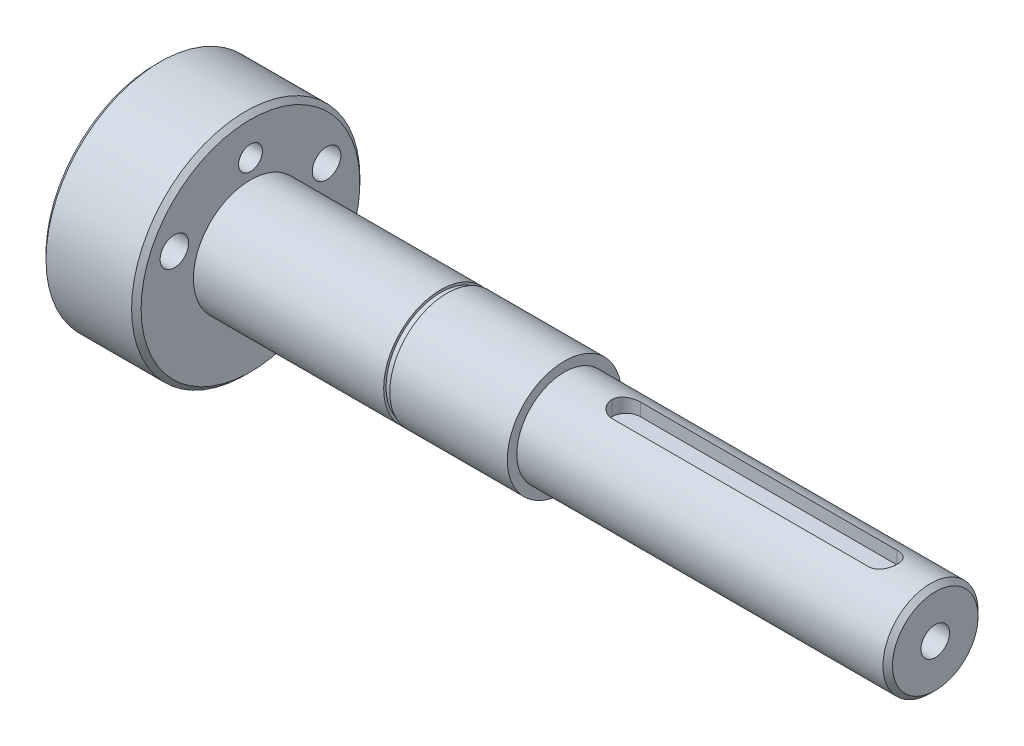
ISO-10303-21;
HEADER;
FILE_DESCRIPTION(('STEP AP214'),'2;1');
FILE_NAME('part.step','',(''),(''),'','','');
FILE_SCHEMA(('AUTOMOTIVE_DESIGN { 1 0 10303 214 1 1 1 1 }'));
ENDSEC;
DATA;
#1=APPLICATION_CONTEXT('core data for automotive mechanical design processes');
#2=APPLICATION_PROTOCOL_DEFINITION('international standard','automotive_design',2000,#1);
#3=PRODUCT_CONTEXT('',#1,'mechanical');
#4=PRODUCT('Part','Part','',(#3));
#5=PRODUCT_RELATED_PRODUCT_CATEGORY('part','',(#4));
#6=PRODUCT_DEFINITION_FORMATION('','',#4);
#7=PRODUCT_DEFINITION_CONTEXT('part definition',#1,'design');
#8=PRODUCT_DEFINITION('design','',#6,#7);
#9=PRODUCT_DEFINITION_SHAPE('','',#8);
#10=(LENGTH_UNIT() NAMED_UNIT(*) SI_UNIT(.MILLI.,.METRE.));
#11=(NAMED_UNIT(*) PLANE_ANGLE_UNIT() SI_UNIT($,.RADIAN.));
#12=(NAMED_UNIT(*) SI_UNIT($,.STERADIAN.) SOLID_ANGLE_UNIT());
#13=UNCERTAINTY_MEASURE_WITH_UNIT(LENGTH_MEASURE(1.E-05),#10,'distance_accuracy_value','');
#14=(GEOMETRIC_REPRESENTATION_CONTEXT(3) GLOBAL_UNCERTAINTY_ASSIGNED_CONTEXT((#13)) GLOBAL_UNIT_ASSIGNED_CONTEXT((#10,
#11,#12)) REPRESENTATION_CONTEXT('',''));
#15=CARTESIAN_POINT('',(0.,0.,0.));
#16=DIRECTION('',(0.,0.,1.));
#17=DIRECTION('',(1.,0.,0.));
#18=AXIS2_PLACEMENT_3D('',#15,#16,#17);
#19=CARTESIAN_POINT('',(0.,0.,0.));
#20=DIRECTION('',(-1.,0.,0.));
#21=DIRECTION('',(0.,0.,1.));
#22=AXIS2_PLACEMENT_3D('',#19,#20,#21);
#23=CYLINDRICAL_SURFACE('',#22,9.99999999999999);
#24=CARTESIAN_POINT('',(163.,0.,0.));
#25=DIRECTION('',(-1.,0.,0.));
#26=DIRECTION('',(0.,0.,1.));
#27=AXIS2_PLACEMENT_3D('',#24,#25,#26);
#28=CIRCLE('',#27,9.99999999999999);
#29=CARTESIAN_POINT('',(163.,0.,9.99999999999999));
#30=VERTEX_POINT('',#29);
#31=EDGE_CURVE('E41',#30,#30,#28,.T.);
#32=ORIENTED_EDGE('',*,*,#31,.T.);
#33=EDGE_LOOP('',(#32));
#34=FACE_BOUND('',#33,.T.);
#35=CARTESIAN_POINT('',(86.,0.,0.));
#36=DIRECTION('',(-1.,0.,0.));
#37=DIRECTION('',(0.,0.,1.));
#38=AXIS2_PLACEMENT_3D('',#35,#36,#37);
#39=CIRCLE('',#38,9.99999999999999);
#40=CARTESIAN_POINT('',(86.,0.,9.99999999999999));
#41=VERTEX_POINT('',#40);
#42=EDGE_CURVE('E114',#41,#41,#39,.T.);
#43=ORIENTED_EDGE('',*,*,#42,.F.);
#44=EDGE_LOOP('',(#43));
#45=FACE_BOUND('',#44,.T.);
#46=DIRECTION('',(-1.,0.,0.));
#47=VECTOR('',#46,1.);
#48=CARTESIAN_POINT('',(0.,9.53939201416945,3.));
#49=LINE('',#48,#47);
#50=CARTESIAN_POINT('',(99.,9.53939201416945,3.));
#51=VERTEX_POINT('',#50);
#52=CARTESIAN_POINT('',(153.,9.53939201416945,3.));
#53=VERTEX_POINT('',#52);
#54=EDGE_CURVE('E123',#51,#53,#49,.F.);
#55=ORIENTED_EDGE('',*,*,#54,.F.);
#56=CARTESIAN_POINT('',(99.,9.53939201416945,3.));
#57=CARTESIAN_POINT('',(98.9176616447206,9.53938054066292,3.00001028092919));
#58=CARTESIAN_POINT('',(98.8353298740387,9.54045779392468,2.9966103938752));
#59=CARTESIAN_POINT('',(98.671294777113,9.54470448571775,2.98307026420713));
#60=CARTESIAN_POINT('',(98.5895913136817,9.5478734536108,2.97293153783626));
#61=CARTESIAN_POINT('',(98.4276012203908,9.55620753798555,2.94602863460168));
#62=CARTESIAN_POINT('',(98.3473114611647,9.56136744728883,2.92928173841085));
#63=CARTESIAN_POINT('',(98.1885187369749,9.57351674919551,2.88932692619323));
#64=CARTESIAN_POINT('',(98.1100158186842,9.58050618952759,2.86611884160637));
#65=CARTESIAN_POINT('',(97.8780531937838,9.60391611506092,2.78708673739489));
#66=CARTESIAN_POINT('',(97.7279365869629,9.62278944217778,2.72182078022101));
#67=CARTESIAN_POINT('',(97.4407785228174,9.66493136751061,2.5681533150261));
#68=CARTESIAN_POINT('',(97.3037436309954,9.68820215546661,2.47974027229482));
#69=CARTESIAN_POINT('',(97.0422787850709,9.73733616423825,2.27930040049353));
#70=CARTESIAN_POINT('',(96.9183185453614,9.76325431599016,2.16667315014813));
#71=CARTESIAN_POINT('',(96.6907289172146,9.81429568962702,1.92227974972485));
#72=CARTESIAN_POINT('',(96.5871034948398,9.83941875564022,1.79050987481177));
#73=CARTESIAN_POINT('',(96.4010451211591,9.88667183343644,1.50818045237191));
#74=CARTESIAN_POINT('',(96.3191023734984,9.90872799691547,1.35728471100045));
#75=CARTESIAN_POINT('',(96.1819863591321,9.94670010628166,1.04312670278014));
#76=CARTESIAN_POINT('',(96.1267899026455,9.96262136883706,0.879875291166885));
#77=CARTESIAN_POINT('',(96.0574621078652,9.98287420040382,0.596528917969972));
#78=CARTESIAN_POINT('',(96.0359572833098,9.98925529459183,0.478332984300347));
#79=CARTESIAN_POINT('',(96.0072119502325,9.9978363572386,0.240114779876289));
#80=CARTESIAN_POINT('',(95.9999664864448,10.0000377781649,0.120093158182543));
#81=CARTESIAN_POINT('',(96.,9.99999999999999,0.));
#82=B_SPLINE_CURVE_WITH_KNOTS('',3,(#56,#57,#58,#59,#60,#61,#62,#63,#64,#65,#66,#67,#68,#69,#70,
#71,#72,#73,#74,#75,#76,#77,#78,#79,#80,#81),.UNSPECIFIED.,.F.,.F.,(4,2,2,2,2,2,2,2,2,2,2,2,4),
(0.,0.246926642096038,0.493797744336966,0.740027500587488,0.986263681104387,1.47812528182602,
1.97023245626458,2.47634460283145,2.98255536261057,3.49938590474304,4.0157675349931,
4.37580149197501,4.73571031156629),.UNSPECIFIED.);
#83=CARTESIAN_POINT('',(96.,9.99999999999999,0.));
#84=VERTEX_POINT('',#83);
#85=EDGE_CURVE('E56',#51,#84,#82,.T.);
#86=ORIENTED_EDGE('',*,*,#85,.T.);
#87=CARTESIAN_POINT('',(96.,9.99999999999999,0.));
#88=CARTESIAN_POINT('',(95.9999899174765,10.0000096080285,-0.082422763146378));
#89=CARTESIAN_POINT('',(96.0033965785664,9.99898119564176,-0.164839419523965));
#90=CARTESIAN_POINT('',(96.0169651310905,9.99491972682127,-0.3290491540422));
#91=CARTESIAN_POINT('',(96.0271256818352,9.99188706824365,-0.41084235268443));
#92=CARTESIAN_POINT('',(96.05409089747,9.98389820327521,-0.573029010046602));
#93=CARTESIAN_POINT('',(96.0708793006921,9.97894670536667,-0.653425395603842));
#94=CARTESIAN_POINT('',(96.1109371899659,9.96726244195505,-0.81243293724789));
#95=CARTESIAN_POINT('',(96.1342068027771,9.9605296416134,-0.891044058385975));
#96=CARTESIAN_POINT('',(96.2134619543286,9.93791665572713,-1.12334751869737));
#97=CARTESIAN_POINT('',(96.27892464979,9.91961224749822,-1.27369353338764));
#98=CARTESIAN_POINT('',(96.4330525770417,9.87844788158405,-1.56123419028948));
#99=CARTESIAN_POINT('',(96.5217275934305,9.8555860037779,-1.69842325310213));
#100=CARTESIAN_POINT('',(96.7224413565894,9.80701615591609,-1.95973032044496));
#101=CARTESIAN_POINT('',(96.8350212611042,9.78125020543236,-2.08342255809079));
#102=CARTESIAN_POINT('',(97.0792077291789,9.73011891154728,-2.31049087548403));
#103=CARTESIAN_POINT('',(97.2108192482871,9.70475367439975,-2.41386164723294));
#104=CARTESIAN_POINT('',(97.4929875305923,9.65667399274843,-2.59963260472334));
#105=CARTESIAN_POINT('',(97.6439077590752,9.63403315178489,-2.68150106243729));
#106=CARTESIAN_POINT('',(97.9581096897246,9.59485969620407,-2.81846982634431));
#107=CARTESIAN_POINT('',(98.1213795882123,9.57832133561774,-2.8735953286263));
#108=CARTESIAN_POINT('',(98.4045358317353,9.5572569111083,-2.94274344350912));
#109=CARTESIAN_POINT('',(98.5225073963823,9.55060700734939,-2.96416883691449));
#110=CARTESIAN_POINT('',(98.7602947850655,9.5416524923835,-2.99281255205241));
#111=CARTESIAN_POINT('',(98.8801101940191,9.5393469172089,-3.00003402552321));
#112=CARTESIAN_POINT('',(99.,9.53939201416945,-3.));
#113=B_SPLINE_CURVE_WITH_KNOTS('',3,(#87,#88,#89,#90,#91,#92,#93,#94,#95,#96,#97,#98,#99,#100,
#101,#102,#103,#104,#105,#106,#107,#108,#109,#110,#111,#112),.UNSPECIFIED.,.F.,.F.,(4,2,2,2,2,2,
2,2,2,2,2,2,4),(0.,0.24718104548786,0.494313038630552,0.740842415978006,0.987376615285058,
1.47989284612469,1.9726170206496,2.47798531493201,2.98348543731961,3.50050825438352,
4.01704300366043,4.37641607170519,4.73570938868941),.UNSPECIFIED.);
#114=CARTESIAN_POINT('',(99.,9.53939201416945,-3.));
#115=VERTEX_POINT('',#114);
#116=EDGE_CURVE('E146',#84,#115,#113,.T.);
#117=ORIENTED_EDGE('',*,*,#116,.T.);
#118=DIRECTION('',(-1.,0.,0.));
#119=VECTOR('',#118,1.);
#120=CARTESIAN_POINT('',(0.,9.53939201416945,-3.));
#121=LINE('',#120,#119);
#122=CARTESIAN_POINT('',(153.,9.53939201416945,-3.));
#123=VERTEX_POINT('',#122);
#124=EDGE_CURVE('E126',#115,#123,#121,.F.);
#125=ORIENTED_EDGE('',*,*,#124,.T.);
#126=CARTESIAN_POINT('',(153.,9.53939201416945,-3.));
#127=CARTESIAN_POINT('',(153.082338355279,9.53938054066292,-3.00001028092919));
#128=CARTESIAN_POINT('',(153.164670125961,9.54045779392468,-2.9966103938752));
#129=CARTESIAN_POINT('',(153.328705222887,9.54470448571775,-2.98307026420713));
#130=CARTESIAN_POINT('',(153.410408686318,9.5478734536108,-2.97293153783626));
#131=CARTESIAN_POINT('',(153.572398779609,9.55620753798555,-2.94602863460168));
#132=CARTESIAN_POINT('',(153.652688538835,9.56136744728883,-2.92928173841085));
#133=CARTESIAN_POINT('',(153.811481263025,9.57351674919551,-2.88932692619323));
#134=CARTESIAN_POINT('',(153.889984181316,9.58050618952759,-2.86611884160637));
#135=CARTESIAN_POINT('',(154.121946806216,9.60391611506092,-2.7870867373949));
#136=CARTESIAN_POINT('',(154.272063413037,9.62278944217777,-2.72182078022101));
#137=CARTESIAN_POINT('',(154.559221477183,9.66493136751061,-2.5681533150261));
#138=CARTESIAN_POINT('',(154.696256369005,9.68820215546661,-2.47974027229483));
#139=CARTESIAN_POINT('',(154.957721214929,9.73733616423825,-2.27930040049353));
#140=CARTESIAN_POINT('',(155.081681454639,9.76325431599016,-2.16667315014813));
#141=CARTESIAN_POINT('',(155.309271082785,9.81429568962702,-1.92227974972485));
#142=CARTESIAN_POINT('',(155.41289650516,9.83941875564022,-1.79050987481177));
#143=CARTESIAN_POINT('',(155.598954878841,9.88667183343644,-1.50818045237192));
#144=CARTESIAN_POINT('',(155.680897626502,9.90872799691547,-1.35728471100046));
#145=CARTESIAN_POINT('',(155.818013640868,9.94670010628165,-1.04312670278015));
#146=CARTESIAN_POINT('',(155.873210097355,9.96262136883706,-0.879875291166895));
#147=CARTESIAN_POINT('',(155.942537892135,9.98287420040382,-0.596528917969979));
#148=CARTESIAN_POINT('',(155.96404271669,9.98925529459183,-0.478332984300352));
#149=CARTESIAN_POINT('',(155.992788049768,9.9978363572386,-0.240114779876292));
#150=CARTESIAN_POINT('',(156.000033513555,10.0000377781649,-0.120093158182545));
#151=CARTESIAN_POINT('',(156.,9.99999999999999,0.));
#152=B_SPLINE_CURVE_WITH_KNOTS('',3,(#126,#127,#128,#129,#130,#131,#132,#133,#134,#135,#136,
#137,#138,#139,#140,#141,#142,#143,#144,#145,#146,#147,#148,#149,#150,#151),.UNSPECIFIED.,.F.,
.F.,(4,2,2,2,2,2,2,2,2,2,2,2,4),(0.,0.246926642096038,0.493797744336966,0.740027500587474,
0.986263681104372,1.47812528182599,1.97023245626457,2.47634460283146,2.98255536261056,
3.49938590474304,4.0157675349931,4.37580149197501,4.73571031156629),.UNSPECIFIED.);
#153=CARTESIAN_POINT('',(156.,9.99999999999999,0.));
#154=VERTEX_POINT('',#153);
#155=EDGE_CURVE('E49',#123,#154,#152,.T.);
#156=ORIENTED_EDGE('',*,*,#155,.T.);
#157=CARTESIAN_POINT('',(156.,9.99999999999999,0.));
#158=CARTESIAN_POINT('',(156.000010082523,10.0000096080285,0.0824227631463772));
#159=CARTESIAN_POINT('',(155.996603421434,9.99898119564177,0.164839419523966));
#160=CARTESIAN_POINT('',(155.983034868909,9.99491972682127,0.329049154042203));
#161=CARTESIAN_POINT('',(155.972874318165,9.99188706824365,0.410842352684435));
#162=CARTESIAN_POINT('',(155.94590910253,9.98389820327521,0.573029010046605));
#163=CARTESIAN_POINT('',(155.929120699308,9.97894670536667,0.653425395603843));
#164=CARTESIAN_POINT('',(155.889062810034,9.96726244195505,0.812432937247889));
#165=CARTESIAN_POINT('',(155.865793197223,9.9605296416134,0.891044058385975));
#166=CARTESIAN_POINT('',(155.786538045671,9.93791665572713,1.12334751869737));
#167=CARTESIAN_POINT('',(155.72107535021,9.91961224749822,1.27369353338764));
#168=CARTESIAN_POINT('',(155.566947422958,9.87844788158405,1.56123419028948));
#169=CARTESIAN_POINT('',(155.47827240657,9.8555860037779,1.69842325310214));
#170=CARTESIAN_POINT('',(155.277558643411,9.80701615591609,1.95973032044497));
#171=CARTESIAN_POINT('',(155.164978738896,9.78125020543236,2.0834225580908));
#172=CARTESIAN_POINT('',(154.920792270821,9.73011891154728,2.31049087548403));
#173=CARTESIAN_POINT('',(154.789180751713,9.70475367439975,2.41386164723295));
#174=CARTESIAN_POINT('',(154.507012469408,9.65667399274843,2.59963260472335));
#175=CARTESIAN_POINT('',(154.356092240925,9.63403315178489,2.68150106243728));
#176=CARTESIAN_POINT('',(154.041890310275,9.59485969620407,2.81846982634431));
#177=CARTESIAN_POINT('',(153.878620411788,9.57832133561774,2.8735953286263));
#178=CARTESIAN_POINT('',(153.595464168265,9.5572569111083,2.94274344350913));
#179=CARTESIAN_POINT('',(153.477492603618,9.55060700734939,2.96416883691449));
#180=CARTESIAN_POINT('',(153.239705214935,9.5416524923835,2.9928125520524));
#181=CARTESIAN_POINT('',(153.119889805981,9.5393469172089,3.00003402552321));
#182=CARTESIAN_POINT('',(153.,9.53939201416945,3.));
#183=B_SPLINE_CURVE_WITH_KNOTS('',3,(#157,#158,#159,#160,#161,#162,#163,#164,#165,#166,#167,
#168,#169,#170,#171,#172,#173,#174,#175,#176,#177,#178,#179,#180,#181,#182),.UNSPECIFIED.,.F.,
.F.,(4,2,2,2,2,2,2,2,2,2,2,2,4),(0.,0.247181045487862,0.494313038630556,0.740842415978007,
0.98737661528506,1.47989284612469,1.9726170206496,2.47798531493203,2.98348543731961,
3.5005082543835,4.01704300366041,4.37641607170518,4.73570938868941),.UNSPECIFIED.);
#184=EDGE_CURVE('E183',#154,#53,#183,.T.);
#185=ORIENTED_EDGE('',*,*,#184,.T.);
#186=EDGE_LOOP('',(#55,#86,#117,#125,#156,#185));
#187=FACE_BOUND('',#186,.T.);
#188=ADVANCED_FACE('F32',(#34,#45,#187),#23,.T.);
#189=CARTESIAN_POINT('',(0.,0.,0.));
#190=DIRECTION('',(-1.,0.,0.));
#191=DIRECTION('',(0.,0.,1.));
#192=AXIS2_PLACEMENT_3D('',#189,#190,#191);
#193=CYLINDRICAL_SURFACE('',#192,12.);
#194=CARTESIAN_POINT('',(86.,0.,0.));
#195=DIRECTION('',(-1.,0.,0.));
#196=DIRECTION('',(0.,0.,1.));
#197=AXIS2_PLACEMENT_3D('',#194,#195,#196);
#198=CIRCLE('',#197,12.);
#199=CARTESIAN_POINT('',(86.,0.,12.));
#200=VERTEX_POINT('',#199);
#201=EDGE_CURVE('E117',#200,#200,#198,.T.);
#202=ORIENTED_EDGE('',*,*,#201,.T.);
#203=EDGE_LOOP('',(#202));
#204=FACE_BOUND('',#203,.T.);
#205=CARTESIAN_POINT('',(61.3,0.,0.));
#206=DIRECTION('',(-1.,0.,0.));
#207=DIRECTION('',(0.,0.,1.));
#208=AXIS2_PLACEMENT_3D('',#205,#206,#207);
#209=CIRCLE('',#208,12.);
#210=CARTESIAN_POINT('',(61.3,0.,12.));
#211=VERTEX_POINT('',#210);
#212=EDGE_CURVE('E105',#211,#211,#209,.T.);
#213=ORIENTED_EDGE('',*,*,#212,.F.);
#214=EDGE_LOOP('',(#213));
#215=FACE_BOUND('',#214,.T.);
#216=ADVANCED_FACE('F241',(#204,#215),#193,.T.);
#217=CARTESIAN_POINT('',(86.,12.,0.));
#218=DIRECTION('',(-1.,0.,0.));
#219=DIRECTION('',(0.,0.,1.));
#220=AXIS2_PLACEMENT_3D('',#217,#218,#219);
#221=PLANE('',#220);
#222=ORIENTED_EDGE('',*,*,#201,.F.);
#223=EDGE_LOOP('',(#222));
#224=FACE_BOUND('',#223,.T.);
#225=ORIENTED_EDGE('',*,*,#42,.T.);
#226=EDGE_LOOP('',(#225));
#227=FACE_BOUND('',#226,.T.);
#228=ADVANCED_FACE('F243',(#224,#227),#221,.F.);
#229=CARTESIAN_POINT('',(164.,9.99999999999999,0.));
#230=DIRECTION('',(-1.,0.,0.));
#231=DIRECTION('',(0.,0.,1.));
#232=AXIS2_PLACEMENT_3D('',#229,#230,#231);
#233=PLANE('',#232);
#234=CARTESIAN_POINT('',(164.,0.,0.));
#235=DIRECTION('',(-1.,0.,0.));
#236=DIRECTION('',(0.,0.,1.));
#237=AXIS2_PLACEMENT_3D('',#234,#235,#236);
#238=CIRCLE('',#237,8.99999999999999);
#239=CARTESIAN_POINT('',(164.,0.,8.99999999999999));
#240=VERTEX_POINT('',#239);
#241=EDGE_CURVE('E11',#240,#240,#238,.F.);
#242=ORIENTED_EDGE('',*,*,#241,.T.);
#243=EDGE_LOOP('',(#242));
#244=FACE_BOUND('',#243,.T.);
#245=CARTESIAN_POINT('',(164.,0.,0.));
#246=DIRECTION('',(1.,0.,0.));
#247=DIRECTION('',(0.,0.,-1.));
#248=AXIS2_PLACEMENT_3D('',#245,#246,#247);
#249=CIRCLE('',#248,3.);
#250=CARTESIAN_POINT('',(164.,0.,-3.));
#251=VERTEX_POINT('',#250);
#252=EDGE_CURVE('E111',#251,#251,#249,.T.);
#253=ORIENTED_EDGE('',*,*,#252,.F.);
#254=EDGE_LOOP('',(#253));
#255=FACE_BOUND('',#254,.T.);
#256=ADVANCED_FACE('F251',(#244,#255),#233,.F.);
#257=CARTESIAN_POINT('',(164.,0.,0.));
#258=DIRECTION('',(1.,0.,0.));
#259=DIRECTION('',(0.,0.,-1.));
#260=AXIS2_PLACEMENT_3D('',#257,#258,#259);
#261=CYLINDRICAL_SURFACE('',#260,3.);
#262=CARTESIAN_POINT('',(152.,0.,0.));
#263=DIRECTION('',(1.,0.,0.));
#264=DIRECTION('',(0.,0.,-1.));
#265=AXIS2_PLACEMENT_3D('',#262,#263,#264);
#266=CIRCLE('',#265,3.);
#267=CARTESIAN_POINT('',(152.,0.,-3.));
#268=VERTEX_POINT('',#267);
#269=EDGE_CURVE('E102',#268,#268,#266,.T.);
#270=ORIENTED_EDGE('',*,*,#269,.F.);
#271=EDGE_LOOP('',(#270));
#272=FACE_BOUND('',#271,.T.);
#273=ORIENTED_EDGE('',*,*,#252,.T.);
#274=EDGE_LOOP('',(#273));
#275=FACE_BOUND('',#274,.T.);
#276=ADVANCED_FACE('F285',(#272,#275),#261,.F.);
#277=CARTESIAN_POINT('',(152.,2.5,0.));
#278=DIRECTION('',(-1.,0.,0.));
#279=DIRECTION('',(0.,0.,1.));
#280=AXIS2_PLACEMENT_3D('',#277,#278,#279);
#281=PLANE('',#280);
#282=CARTESIAN_POINT('',(152.,0.,0.));
#283=DIRECTION('',(1.,0.,0.));
#284=DIRECTION('',(0.,0.,-1.));
#285=AXIS2_PLACEMENT_3D('',#282,#283,#284);
#286=CIRCLE('',#285,2.5);
#287=CARTESIAN_POINT('',(152.,0.,-2.5));
#288=VERTEX_POINT('',#287);
#289=EDGE_CURVE('E98',#288,#288,#286,.T.);
#290=ORIENTED_EDGE('',*,*,#289,.F.);
#291=EDGE_LOOP('',(#290));
#292=FACE_BOUND('',#291,.T.);
#293=ORIENTED_EDGE('',*,*,#269,.T.);
#294=EDGE_LOOP('',(#293));
#295=FACE_BOUND('',#294,.T.);
#296=ADVANCED_FACE('F282',(#292,#295),#281,.F.);
#297=CARTESIAN_POINT('',(164.,0.,0.));
#298=DIRECTION('',(1.,0.,0.));
#299=DIRECTION('',(0.,0.,-1.));
#300=AXIS2_PLACEMENT_3D('',#297,#298,#299);
#301=CYLINDRICAL_SURFACE('',#300,2.5);
#302=CARTESIAN_POINT('',(147.,0.,0.));
#303=DIRECTION('',(1.,0.,0.));
#304=DIRECTION('',(0.,0.,-1.));
#305=AXIS2_PLACEMENT_3D('',#302,#303,#304);
#306=CIRCLE('',#305,2.5);
#307=CARTESIAN_POINT('',(147.,0.,-2.5));
#308=VERTEX_POINT('',#307);
#309=EDGE_CURVE('E96',#308,#308,#306,.T.);
#310=ORIENTED_EDGE('',*,*,#309,.F.);
#311=EDGE_LOOP('',(#310));
#312=FACE_BOUND('',#311,.T.);
#313=ORIENTED_EDGE('',*,*,#289,.T.);
#314=EDGE_LOOP('',(#313));
#315=FACE_BOUND('',#314,.T.);
#316=ADVANCED_FACE('F92',(#312,#315),#301,.F.);
#317=CARTESIAN_POINT('',(147.,0.,0.));
#318=DIRECTION('',(1.,0.,0.));
#319=DIRECTION('',(0.,0.,-1.));
#320=AXIS2_PLACEMENT_3D('',#317,#318,#319);
#321=CONICAL_SURFACE('',#320,2.5,1.02974425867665);
#322=CARTESIAN_POINT('',(145.497848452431,0.,0.));
#323=VERTEX_POINT('',#322);
#324=VERTEX_LOOP('',#323);
#325=FACE_BOUND('',#324,.T.);
#326=ORIENTED_EDGE('',*,*,#309,.T.);
#327=EDGE_LOOP('',(#326));
#328=FACE_BOUND('',#327,.T.);
#329=ADVANCED_FACE('F88',(#325,#328),#321,.F.);
#330=CARTESIAN_POINT('',(60.,11.5,0.));
#331=DIRECTION('',(1.,0.,0.));
#332=DIRECTION('',(0.,0.,-1.));
#333=AXIS2_PLACEMENT_3D('',#330,#331,#332);
#334=PLANE('',#333);
#335=CARTESIAN_POINT('',(60.,0.,0.));
#336=DIRECTION('',(-1.,0.,0.));
#337=DIRECTION('',(0.,0.,1.));
#338=AXIS2_PLACEMENT_3D('',#335,#336,#337);
#339=CIRCLE('',#338,11.5);
#340=CARTESIAN_POINT('',(60.,0.,11.5));
#341=VERTEX_POINT('',#340);
#342=EDGE_CURVE('E230',#341,#341,#339,.T.);
#343=ORIENTED_EDGE('',*,*,#342,.T.);
#344=EDGE_LOOP('',(#343));
#345=FACE_BOUND('',#344,.T.);
#346=CARTESIAN_POINT('',(60.,0.,0.));
#347=DIRECTION('',(-1.,0.,0.));
#348=DIRECTION('',(0.,0.,1.));
#349=AXIS2_PLACEMENT_3D('',#346,#347,#348);
#350=CIRCLE('',#349,12.);
#351=CARTESIAN_POINT('',(60.,0.,12.));
#352=VERTEX_POINT('',#351);
#353=EDGE_CURVE('E99',#352,#352,#350,.T.);
#354=ORIENTED_EDGE('',*,*,#353,.F.);
#355=EDGE_LOOP('',(#354));
#356=FACE_BOUND('',#355,.T.);
#357=ADVANCED_FACE('F91',(#345,#356),#334,.T.);
#358=CARTESIAN_POINT('',(61.3,11.5,0.));
#359=DIRECTION('',(-1.,0.,0.));
#360=DIRECTION('',(0.,0.,1.));
#361=AXIS2_PLACEMENT_3D('',#358,#359,#360);
#362=PLANE('',#361);
#363=ORIENTED_EDGE('',*,*,#212,.T.);
#364=EDGE_LOOP('',(#363));
#365=FACE_BOUND('',#364,.T.);
#366=CARTESIAN_POINT('',(61.3,0.,0.));
#367=DIRECTION('',(-1.,0.,0.));
#368=DIRECTION('',(0.,0.,1.));
#369=AXIS2_PLACEMENT_3D('',#366,#367,#368);
#370=CIRCLE('',#369,11.5);
#371=CARTESIAN_POINT('',(61.3,0.,11.5));
#372=VERTEX_POINT('',#371);
#373=EDGE_CURVE('E233',#372,#372,#370,.T.);
#374=ORIENTED_EDGE('',*,*,#373,.F.);
#375=EDGE_LOOP('',(#374));
#376=FACE_BOUND('',#375,.T.);
#377=ADVANCED_FACE('F238',(#365,#376),#362,.T.);
#378=CARTESIAN_POINT('',(0.,0.,0.));
#379=DIRECTION('',(-1.,0.,0.));
#380=DIRECTION('',(0.,0.,1.));
#381=AXIS2_PLACEMENT_3D('',#378,#379,#380);
#382=CYLINDRICAL_SURFACE('',#381,11.5);
#383=ORIENTED_EDGE('',*,*,#373,.T.);
#384=EDGE_LOOP('',(#383));
#385=FACE_BOUND('',#384,.T.);
#386=ORIENTED_EDGE('',*,*,#342,.F.);
#387=EDGE_LOOP('',(#386));
#388=FACE_BOUND('',#387,.T.);
#389=ADVANCED_FACE('F276',(#385,#388),#382,.T.);
#390=CARTESIAN_POINT('',(0.,0.,0.));
#391=DIRECTION('',(1.,0.,0.));
#392=DIRECTION('',(0.,0.,-1.));
#393=AXIS2_PLACEMENT_3D('',#390,#391,#392);
#394=PLANE('',#393);
#395=CARTESIAN_POINT('',(0.,16.,0.));
#396=DIRECTION('',(-1.,0.,0.));
#397=DIRECTION('',(0.,0.,1.));
#398=AXIS2_PLACEMENT_3D('',#395,#396,#397);
#399=CIRCLE('',#398,2.5);
#400=CARTESIAN_POINT('',(0.,16.,2.5));
#401=VERTEX_POINT('',#400);
#402=EDGE_CURVE('E216',#401,#401,#399,.T.);
#403=ORIENTED_EDGE('',*,*,#402,.F.);
#404=EDGE_LOOP('',(#403));
#405=FACE_BOUND('',#404,.T.);
#406=CARTESIAN_POINT('',(0.,7.,16.));
#407=DIRECTION('',(-1.,0.,0.));
#408=DIRECTION('',(0.,0.,1.));
#409=AXIS2_PLACEMENT_3D('',#406,#407,#408);
#410=CIRCLE('',#409,3.);
#411=CARTESIAN_POINT('',(0.,7.,19.));
#412=VERTEX_POINT('',#411);
#413=EDGE_CURVE('E206',#412,#412,#410,.T.);
#414=ORIENTED_EDGE('',*,*,#413,.F.);
#415=EDGE_LOOP('',(#414));
#416=FACE_BOUND('',#415,.T.);
#417=CARTESIAN_POINT('',(0.,7.,-16.));
#418=DIRECTION('',(-1.,0.,0.));
#419=DIRECTION('',(0.,0.,1.));
#420=AXIS2_PLACEMENT_3D('',#417,#418,#419);
#421=CIRCLE('',#420,3.);
#422=CARTESIAN_POINT('',(0.,7.,-13.));
#423=VERTEX_POINT('',#422);
#424=EDGE_CURVE('E203',#423,#423,#421,.T.);
#425=ORIENTED_EDGE('',*,*,#424,.F.);
#426=EDGE_LOOP('',(#425));
#427=FACE_BOUND('',#426,.T.);
#428=CARTESIAN_POINT('',(0.,0.,0.));
#429=DIRECTION('',(1.,0.,0.));
#430=DIRECTION('',(0.,0.,-1.));
#431=AXIS2_PLACEMENT_3D('',#428,#429,#430);
#432=CIRCLE('',#431,23.);
#433=CARTESIAN_POINT('',(0.,0.,-23.));
#434=VERTEX_POINT('',#433);
#435=EDGE_CURVE('E195',#434,#434,#432,.F.);
#436=ORIENTED_EDGE('',*,*,#435,.T.);
#437=EDGE_LOOP('',(#436));
#438=FACE_BOUND('',#437,.T.);
#439=ADVANCED_FACE('F34',(#405,#416,#427,#438),#394,.F.);
#440=CARTESIAN_POINT('',(0.,0.,0.));
#441=DIRECTION('',(-1.,0.,0.));
#442=DIRECTION('',(0.,0.,1.));
#443=AXIS2_PLACEMENT_3D('',#440,#441,#442);
#444=CYLINDRICAL_SURFACE('',#443,24.);
#445=CARTESIAN_POINT('',(19.,0.,0.));
#446=DIRECTION('',(-1.,0.,0.));
#447=DIRECTION('',(0.,0.,1.));
#448=AXIS2_PLACEMENT_3D('',#445,#446,#447);
#449=CIRCLE('',#448,24.);
#450=CARTESIAN_POINT('',(19.,0.,24.));
#451=VERTEX_POINT('',#450);
#452=EDGE_CURVE('E189',#451,#451,#449,.T.);
#453=ORIENTED_EDGE('',*,*,#452,.T.);
#454=EDGE_LOOP('',(#453));
#455=FACE_BOUND('',#454,.T.);
#456=CARTESIAN_POINT('',(1.00000000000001,0.,0.));
#457=DIRECTION('',(1.,0.,0.));
#458=DIRECTION('',(0.,0.,-1.));
#459=AXIS2_PLACEMENT_3D('',#456,#457,#458);
#460=CIRCLE('',#459,24.);
#461=CARTESIAN_POINT('',(1.00000000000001,0.,-24.));
#462=VERTEX_POINT('',#461);
#463=EDGE_CURVE('E182',#462,#462,#460,.T.);
#464=ORIENTED_EDGE('',*,*,#463,.T.);
#465=EDGE_LOOP('',(#464));
#466=FACE_BOUND('',#465,.T.);
#467=ADVANCED_FACE('F264',(#455,#466),#444,.T.);
#468=CARTESIAN_POINT('',(20.,24.,0.));
#469=DIRECTION('',(-1.,0.,0.));
#470=DIRECTION('',(0.,0.,1.));
#471=AXIS2_PLACEMENT_3D('',#468,#469,#470);
#472=PLANE('',#471);
#473=CARTESIAN_POINT('',(20.,16.,0.));
#474=DIRECTION('',(-1.,0.,0.));
#475=DIRECTION('',(0.,0.,1.));
#476=AXIS2_PLACEMENT_3D('',#473,#474,#475);
#477=CIRCLE('',#476,2.5);
#478=CARTESIAN_POINT('',(20.,16.,2.5));
#479=VERTEX_POINT('',#478);
#480=EDGE_CURVE('E36',#479,#479,#477,.T.);
#481=ORIENTED_EDGE('',*,*,#480,.T.);
#482=EDGE_LOOP('',(#481));
#483=FACE_BOUND('',#482,.T.);
#484=CARTESIAN_POINT('',(20.,7.,16.));
#485=DIRECTION('',(-1.,0.,0.));
#486=DIRECTION('',(0.,0.,1.));
#487=AXIS2_PLACEMENT_3D('',#484,#485,#486);
#488=CIRCLE('',#487,3.);
#489=CARTESIAN_POINT('',(20.,7.,19.));
#490=VERTEX_POINT('',#489);
#491=EDGE_CURVE('E204',#490,#490,#488,.T.);
#492=ORIENTED_EDGE('',*,*,#491,.T.);
#493=EDGE_LOOP('',(#492));
#494=FACE_BOUND('',#493,.T.);
#495=CARTESIAN_POINT('',(20.,7.,-16.));
#496=DIRECTION('',(-1.,0.,0.));
#497=DIRECTION('',(0.,0.,1.));
#498=AXIS2_PLACEMENT_3D('',#495,#496,#497);
#499=CIRCLE('',#498,3.);
#500=CARTESIAN_POINT('',(20.,7.,-13.));
#501=VERTEX_POINT('',#500);
#502=EDGE_CURVE('E200',#501,#501,#499,.T.);
#503=ORIENTED_EDGE('',*,*,#502,.T.);
#504=EDGE_LOOP('',(#503));
#505=FACE_BOUND('',#504,.T.);
#506=CARTESIAN_POINT('',(20.,0.,0.));
#507=DIRECTION('',(-1.,0.,0.));
#508=DIRECTION('',(0.,0.,1.));
#509=AXIS2_PLACEMENT_3D('',#506,#507,#508);
#510=CIRCLE('',#509,23.);
#511=CARTESIAN_POINT('',(20.,0.,23.));
#512=VERTEX_POINT('',#511);
#513=EDGE_CURVE('E192',#512,#512,#510,.F.);
#514=ORIENTED_EDGE('',*,*,#513,.T.);
#515=EDGE_LOOP('',(#514));
#516=FACE_BOUND('',#515,.T.);
#517=CARTESIAN_POINT('',(20.,0.,0.));
#518=DIRECTION('',(-1.,0.,0.));
#519=DIRECTION('',(0.,0.,1.));
#520=AXIS2_PLACEMENT_3D('',#517,#518,#519);
#521=CIRCLE('',#520,12.);
#522=CARTESIAN_POINT('',(20.,0.,12.));
#523=VERTEX_POINT('',#522);
#524=EDGE_CURVE('E120',#523,#523,#521,.T.);
#525=ORIENTED_EDGE('',*,*,#524,.T.);
#526=EDGE_LOOP('',(#525));
#527=FACE_BOUND('',#526,.T.);
#528=ADVANCED_FACE('F257',(#483,#494,#505,#516,#527),#472,.F.);
#529=ORIENTED_EDGE('',*,*,#524,.F.);
#530=EDGE_LOOP('',(#529));
#531=FACE_BOUND('',#530,.T.);
#532=ORIENTED_EDGE('',*,*,#353,.T.);
#533=EDGE_LOOP('',(#532));
#534=FACE_BOUND('',#533,.T.);
#535=ADVANCED_FACE('F246',(#531,#534),#193,.T.);
#536=CARTESIAN_POINT('',(96.,9.99999999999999,-3.));
#537=DIRECTION('',(0.,0.,-1.));
#538=DIRECTION('',(-1.,0.,0.));
#539=AXIS2_PLACEMENT_3D('',#536,#537,#538);
#540=PLANE('',#539);
#541=ORIENTED_EDGE('',*,*,#124,.F.);
#542=DIRECTION('',(0.,-1.,0.));
#543=VECTOR('',#542,1.);
#544=CARTESIAN_POINT('',(99.,6.85436361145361,-3.));
#545=LINE('',#544,#543);
#546=CARTESIAN_POINT('',(99.,6.85436361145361,-3.));
#547=VERTEX_POINT('',#546);
#548=EDGE_CURVE('E131',#115,#547,#545,.T.);
#549=ORIENTED_EDGE('',*,*,#548,.T.);
#550=DIRECTION('',(1.,0.,0.));
#551=VECTOR('',#550,1.);
#552=CARTESIAN_POINT('',(96.,6.85436361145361,-3.));
#553=LINE('',#552,#551);
#554=CARTESIAN_POINT('',(153.,6.85436361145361,-3.));
#555=VERTEX_POINT('',#554);
#556=EDGE_CURVE('E227',#547,#555,#553,.T.);
#557=ORIENTED_EDGE('',*,*,#556,.T.);
#558=DIRECTION('',(0.,1.,0.));
#559=VECTOR('',#558,1.);
#560=CARTESIAN_POINT('',(153.,9.53939201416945,-3.));
#561=LINE('',#560,#559);
#562=EDGE_CURVE('E128',#555,#123,#561,.T.);
#563=ORIENTED_EDGE('',*,*,#562,.T.);
#564=EDGE_LOOP('',(#541,#549,#557,#563));
#565=FACE_BOUND('',#564,.T.);
#566=ADVANCED_FACE('F256',(#565),#540,.F.);
#567=CARTESIAN_POINT('',(96.,9.99999999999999,3.));
#568=DIRECTION('',(0.,0.,-1.));
#569=DIRECTION('',(-1.,0.,0.));
#570=AXIS2_PLACEMENT_3D('',#567,#568,#569);
#571=PLANE('',#570);
#572=ORIENTED_EDGE('',*,*,#54,.T.);
#573=DIRECTION('',(0.,1.,0.));
#574=VECTOR('',#573,1.);
#575=CARTESIAN_POINT('',(153.,9.99999999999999,3.));
#576=LINE('',#575,#574);
#577=CARTESIAN_POINT('',(153.,6.85436361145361,3.));
#578=VERTEX_POINT('',#577);
#579=EDGE_CURVE('E144',#53,#578,#576,.F.);
#580=ORIENTED_EDGE('',*,*,#579,.T.);
#581=DIRECTION('',(1.,0.,0.));
#582=VECTOR('',#581,1.);
#583=CARTESIAN_POINT('',(96.,6.85436361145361,3.));
#584=LINE('',#583,#582);
#585=CARTESIAN_POINT('',(99.,6.85436361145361,3.));
#586=VERTEX_POINT('',#585);
#587=EDGE_CURVE('E224',#586,#578,#584,.T.);
#588=ORIENTED_EDGE('',*,*,#587,.F.);
#589=DIRECTION('',(0.,-1.,0.));
#590=VECTOR('',#589,1.);
#591=CARTESIAN_POINT('',(99.,9.99999999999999,3.));
#592=LINE('',#591,#590);
#593=EDGE_CURVE('E142',#586,#51,#592,.F.);
#594=ORIENTED_EDGE('',*,*,#593,.T.);
#595=EDGE_LOOP('',(#572,#580,#588,#594));
#596=FACE_BOUND('',#595,.T.);
#597=ADVANCED_FACE('F175',(#596),#571,.T.);
#598=CARTESIAN_POINT('',(96.,6.85436361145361,-3.));
#599=DIRECTION('',(0.,-1.,0.));
#600=DIRECTION('',(0.,0.,-1.));
#601=AXIS2_PLACEMENT_3D('',#598,#599,#600);
#602=PLANE('',#601);
#603=CARTESIAN_POINT('',(153.,6.85436361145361,0.));
#604=DIRECTION('',(0.,-1.,0.));
#605=DIRECTION('',(0.,0.,-1.));
#606=AXIS2_PLACEMENT_3D('',#603,#604,#605);
#607=CIRCLE('',#606,3.);
#608=CARTESIAN_POINT('',(156.,6.85436361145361,0.));
#609=VERTEX_POINT('',#608);
#610=EDGE_CURVE('E138',#578,#609,#607,.F.);
#611=ORIENTED_EDGE('',*,*,#610,.T.);
#612=CARTESIAN_POINT('',(153.,6.85436361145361,0.));
#613=DIRECTION('',(0.,-1.,0.));
#614=DIRECTION('',(0.,0.,-1.));
#615=AXIS2_PLACEMENT_3D('',#612,#613,#614);
#616=CIRCLE('',#615,3.);
#617=EDGE_CURVE('E140',#609,#555,#616,.F.);
#618=ORIENTED_EDGE('',*,*,#617,.T.);
#619=ORIENTED_EDGE('',*,*,#556,.F.);
#620=CARTESIAN_POINT('',(99.,6.85436361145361,0.));
#621=DIRECTION('',(0.,-1.,0.));
#622=DIRECTION('',(0.,0.,-1.));
#623=AXIS2_PLACEMENT_3D('',#620,#621,#622);
#624=CIRCLE('',#623,3.);
#625=CARTESIAN_POINT('',(96.,6.85436361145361,0.));
#626=VERTEX_POINT('',#625);
#627=EDGE_CURVE('E136',#547,#626,#624,.F.);
#628=ORIENTED_EDGE('',*,*,#627,.T.);
#629=CARTESIAN_POINT('',(99.,6.85436361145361,0.));
#630=DIRECTION('',(0.,-1.,0.));
#631=DIRECTION('',(0.,0.,-1.));
#632=AXIS2_PLACEMENT_3D('',#629,#630,#631);
#633=CIRCLE('',#632,3.);
#634=EDGE_CURVE('E134',#626,#586,#633,.F.);
#635=ORIENTED_EDGE('',*,*,#634,.T.);
#636=ORIENTED_EDGE('',*,*,#587,.T.);
#637=EDGE_LOOP('',(#611,#618,#619,#628,#635,#636));
#638=FACE_BOUND('',#637,.T.);
#639=ADVANCED_FACE('F173',(#638),#602,.F.);
#640=CARTESIAN_POINT('',(99.,6.85436361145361,0.));
#641=DIRECTION('',(0.,-1.,0.));
#642=DIRECTION('',(0.,0.,-1.));
#643=AXIS2_PLACEMENT_3D('',#640,#641,#642);
#644=CYLINDRICAL_SURFACE('',#643,3.);
#645=DIRECTION('',(0.,-1.,0.));
#646=VECTOR('',#645,1.);
#647=CARTESIAN_POINT('',(96.,6.85436361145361,0.));
#648=LINE('',#647,#646);
#649=EDGE_CURVE('E221',#84,#626,#648,.T.);
#650=ORIENTED_EDGE('',*,*,#649,.F.);
#651=ORIENTED_EDGE('',*,*,#85,.F.);
#652=ORIENTED_EDGE('',*,*,#593,.F.);
#653=ORIENTED_EDGE('',*,*,#634,.F.);
#654=EDGE_LOOP('',(#650,#651,#652,#653));
#655=FACE_BOUND('',#654,.T.);
#656=ADVANCED_FACE('F167',(#655),#644,.F.);
#657=CARTESIAN_POINT('',(99.,9.99999999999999,0.));
#658=DIRECTION('',(0.,1.,0.));
#659=DIRECTION('',(0.,0.,1.));
#660=AXIS2_PLACEMENT_3D('',#657,#658,#659);
#661=CYLINDRICAL_SURFACE('',#660,3.);
#662=ORIENTED_EDGE('',*,*,#116,.F.);
#663=ORIENTED_EDGE('',*,*,#649,.T.);
#664=ORIENTED_EDGE('',*,*,#627,.F.);
#665=ORIENTED_EDGE('',*,*,#548,.F.);
#666=EDGE_LOOP('',(#662,#663,#664,#665));
#667=FACE_BOUND('',#666,.T.);
#668=ADVANCED_FACE('F161',(#667),#661,.F.);
#669=CARTESIAN_POINT('',(153.,6.85436361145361,0.));
#670=DIRECTION('',(0.,1.,0.));
#671=DIRECTION('',(0.,0.,1.));
#672=AXIS2_PLACEMENT_3D('',#669,#670,#671);
#673=CYLINDRICAL_SURFACE('',#672,3.);
#674=DIRECTION('',(0.,1.,0.));
#675=VECTOR('',#674,1.);
#676=CARTESIAN_POINT('',(156.,6.85436361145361,0.));
#677=LINE('',#676,#675);
#678=EDGE_CURVE('E202',#609,#154,#677,.T.);
#679=ORIENTED_EDGE('',*,*,#678,.F.);
#680=ORIENTED_EDGE('',*,*,#610,.F.);
#681=ORIENTED_EDGE('',*,*,#579,.F.);
#682=ORIENTED_EDGE('',*,*,#184,.F.);
#683=EDGE_LOOP('',(#679,#680,#681,#682));
#684=FACE_BOUND('',#683,.T.);
#685=ADVANCED_FACE('F166',(#684),#673,.F.);
#686=CARTESIAN_POINT('',(153.,9.99999999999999,0.));
#687=DIRECTION('',(0.,-1.,0.));
#688=DIRECTION('',(0.,0.,-1.));
#689=AXIS2_PLACEMENT_3D('',#686,#687,#688);
#690=CYLINDRICAL_SURFACE('',#689,3.);
#691=ORIENTED_EDGE('',*,*,#617,.F.);
#692=ORIENTED_EDGE('',*,*,#678,.T.);
#693=ORIENTED_EDGE('',*,*,#155,.F.);
#694=ORIENTED_EDGE('',*,*,#562,.F.);
#695=EDGE_LOOP('',(#691,#692,#693,#694));
#696=FACE_BOUND('',#695,.T.);
#697=ADVANCED_FACE('F318',(#696),#690,.F.);
#698=CARTESIAN_POINT('',(19.,0.,0.));
#699=DIRECTION('',(-1.,0.,0.));
#700=DIRECTION('',(0.,0.,1.));
#701=AXIS2_PLACEMENT_3D('',#698,#699,#700);
#702=CONICAL_SURFACE('',#701,24.,0.785398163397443);
#703=ORIENTED_EDGE('',*,*,#513,.F.);
#704=EDGE_LOOP('',(#703));
#705=FACE_BOUND('',#704,.T.);
#706=ORIENTED_EDGE('',*,*,#452,.F.);
#707=EDGE_LOOP('',(#706));
#708=FACE_BOUND('',#707,.T.);
#709=ADVANCED_FACE('F351',(#705,#708),#702,.T.);
#710=CARTESIAN_POINT('',(0.,0.,0.));
#711=DIRECTION('',(1.,0.,0.));
#712=DIRECTION('',(0.,0.,-1.));
#713=AXIS2_PLACEMENT_3D('',#710,#711,#712);
#714=CONICAL_SURFACE('',#713,23.,0.785398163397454);
#715=ORIENTED_EDGE('',*,*,#463,.F.);
#716=EDGE_LOOP('',(#715));
#717=FACE_BOUND('',#716,.T.);
#718=ORIENTED_EDGE('',*,*,#435,.F.);
#719=EDGE_LOOP('',(#718));
#720=FACE_BOUND('',#719,.T.);
#721=ADVANCED_FACE('F302',(#717,#720),#714,.T.);
#722=CARTESIAN_POINT('',(163.,0.,0.));
#723=DIRECTION('',(-1.,0.,0.));
#724=DIRECTION('',(0.,0.,1.));
#725=AXIS2_PLACEMENT_3D('',#722,#723,#724);
#726=CONICAL_SURFACE('',#725,9.99999999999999,0.785398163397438);
#727=ORIENTED_EDGE('',*,*,#241,.F.);
#728=EDGE_LOOP('',(#727));
#729=FACE_BOUND('',#728,.T.);
#730=ORIENTED_EDGE('',*,*,#31,.F.);
#731=EDGE_LOOP('',(#730));
#732=FACE_BOUND('',#731,.T.);
#733=ADVANCED_FACE('F298',(#729,#732),#726,.T.);
#734=CARTESIAN_POINT('',(164.,7.,-16.));
#735=DIRECTION('',(-1.,0.,0.));
#736=DIRECTION('',(0.,0.,1.));
#737=AXIS2_PLACEMENT_3D('',#734,#735,#736);
#738=CYLINDRICAL_SURFACE('',#737,3.);
#739=ORIENTED_EDGE('',*,*,#424,.T.);
#740=EDGE_LOOP('',(#739));
#741=FACE_BOUND('',#740,.T.);
#742=ORIENTED_EDGE('',*,*,#502,.F.);
#743=EDGE_LOOP('',(#742));
#744=FACE_BOUND('',#743,.T.);
#745=ADVANCED_FACE('F301',(#741,#744),#738,.F.);
#746=CARTESIAN_POINT('',(164.,7.,16.));
#747=DIRECTION('',(-1.,0.,0.));
#748=DIRECTION('',(0.,0.,1.));
#749=AXIS2_PLACEMENT_3D('',#746,#747,#748);
#750=CYLINDRICAL_SURFACE('',#749,3.);
#751=ORIENTED_EDGE('',*,*,#413,.T.);
#752=EDGE_LOOP('',(#751));
#753=FACE_BOUND('',#752,.T.);
#754=ORIENTED_EDGE('',*,*,#491,.F.);
#755=EDGE_LOOP('',(#754));
#756=FACE_BOUND('',#755,.T.);
#757=ADVANCED_FACE('F502',(#753,#756),#750,.F.);
#758=CARTESIAN_POINT('',(164.,16.,0.));
#759=DIRECTION('',(-1.,0.,0.));
#760=DIRECTION('',(0.,0.,1.));
#761=AXIS2_PLACEMENT_3D('',#758,#759,#760);
#762=CYLINDRICAL_SURFACE('',#761,2.5);
#763=ORIENTED_EDGE('',*,*,#402,.T.);
#764=EDGE_LOOP('',(#763));
#765=FACE_BOUND('',#764,.T.);
#766=ORIENTED_EDGE('',*,*,#480,.F.);
#767=EDGE_LOOP('',(#766));
#768=FACE_BOUND('',#767,.T.);
#769=ADVANCED_FACE('F510',(#765,#768),#762,.F.);
#770=CLOSED_SHELL('',(#188,#216,#228,#256,#276,#296,#316,#329,#357,#377,#389,#439,#467,#528,
#535,#566,#597,#639,#656,#668,#685,#697,#709,#721,#733,#745,#757,#769));
#771=MANIFOLD_SOLID_BREP('B2',#770);
#772=ADVANCED_BREP_SHAPE_REPRESENTATION('',(#18,#771),#14);
#773=SHAPE_DEFINITION_REPRESENTATION(#9,#772);
ENDSEC;
END-ISO-10303-21;
